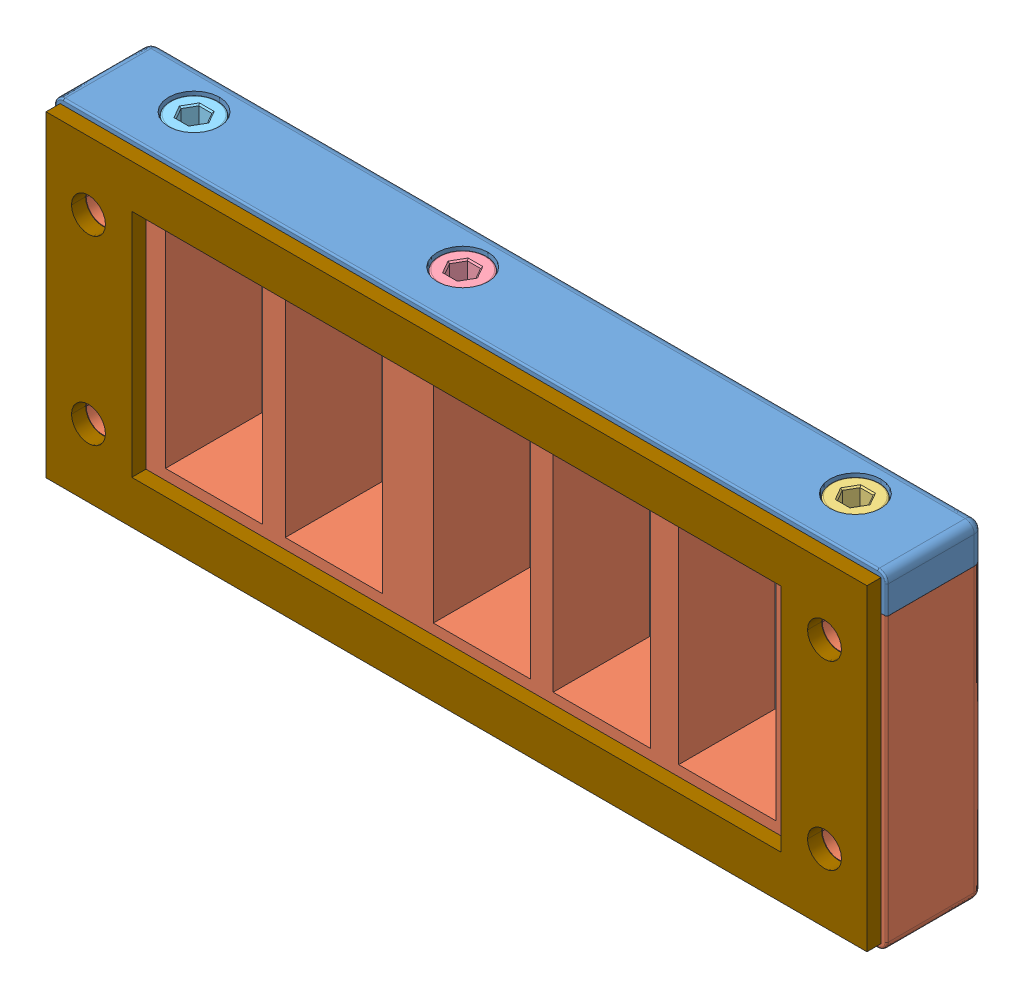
SolidWorks assembly 70000_200.SLDASM, configuration Default (file format 8000). Lengths in mm.
Overall size (147 58 19.55).
9 component instances, 9 part files, 0 mates.
Components (placement in the parent):
- 70000_200_01-1: 70000_200_01.SLDPRT [Default] at origin size (147 10.49 17.05)
- 70000_200_02-1: 70000_200_02.SLDPRT [Default] at origin size (147 51.5 17.05)
- 70000_200_03-1: 70000_200_03.SLDPRT [Default] at origin size (8.5 57 8.5)
- 70000_200_04-1: 70000_200_04.SLDPRT [Default] at origin size (8.5 57 8.5)
- 70000_200_05-1: 70000_200_05.SLDPRT [Default] at origin size (8.5 57 8.5)
- 70000_200_06-1: 70000_200_06.SLDPRT [Default] at origin size (9.25 4.7 8.01)
- 70000_200_07-1: 70000_200_07.SLDPRT [Default] at origin size (9.25 4.7 8.01)
- 70000_200_08-1: 70000_200_08.SLDPRT [Default] at origin size (9.25 4.7 8.01)
- 70000_200_09-1: 70000_200_09.SLDPRT [Default] at origin size (145 56 2.5)
